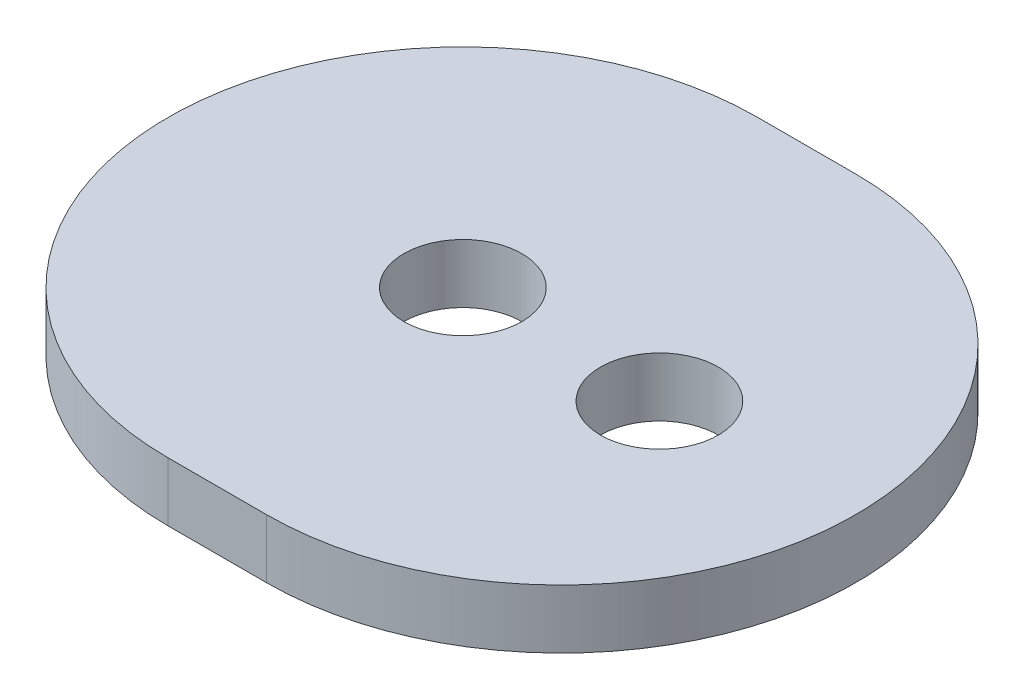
ISO-10303-21;
HEADER;
FILE_DESCRIPTION(('STEP AP214'),'2;1');
FILE_NAME('part.step','',(''),(''),'','','');
FILE_SCHEMA(('AUTOMOTIVE_DESIGN { 1 0 10303 214 1 1 1 1 }'));
ENDSEC;
DATA;
#1=APPLICATION_CONTEXT('core data for automotive mechanical design processes');
#2=APPLICATION_PROTOCOL_DEFINITION('international standard','automotive_design',2000,#1);
#3=PRODUCT_CONTEXT('',#1,'mechanical');
#4=PRODUCT('Part','Part','',(#3));
#5=PRODUCT_RELATED_PRODUCT_CATEGORY('part','',(#4));
#6=PRODUCT_DEFINITION_FORMATION('','',#4);
#7=PRODUCT_DEFINITION_CONTEXT('part definition',#1,'design');
#8=PRODUCT_DEFINITION('design','',#6,#7);
#9=PRODUCT_DEFINITION_SHAPE('','',#8);
#10=(LENGTH_UNIT() NAMED_UNIT(*) SI_UNIT(.MILLI.,.METRE.));
#11=(NAMED_UNIT(*) PLANE_ANGLE_UNIT() SI_UNIT($,.RADIAN.));
#12=(NAMED_UNIT(*) SI_UNIT($,.STERADIAN.) SOLID_ANGLE_UNIT());
#13=UNCERTAINTY_MEASURE_WITH_UNIT(LENGTH_MEASURE(1.E-05),#10,'distance_accuracy_value','');
#14=(GEOMETRIC_REPRESENTATION_CONTEXT(3) GLOBAL_UNCERTAINTY_ASSIGNED_CONTEXT((#13)) GLOBAL_UNIT_ASSIGNED_CONTEXT((#10,
#11,#12)) REPRESENTATION_CONTEXT('',''));
#15=CARTESIAN_POINT('',(0.,0.,0.));
#16=DIRECTION('',(0.,0.,1.));
#17=DIRECTION('',(1.,0.,0.));
#18=AXIS2_PLACEMENT_3D('',#15,#16,#17);
#19=CARTESIAN_POINT('',(5.,3.,0.));
#20=DIRECTION('',(0.,1.,0.));
#21=DIRECTION('',(0.,0.,1.));
#22=AXIS2_PLACEMENT_3D('',#19,#20,#21);
#23=PLANE('',#22);
#24=CARTESIAN_POINT('',(10.,3.,0.));
#25=DIRECTION('',(0.,1.,0.));
#26=DIRECTION('',(0.,0.,1.));
#27=AXIS2_PLACEMENT_3D('',#24,#25,#26);
#28=CIRCLE('',#27,3.);
#29=CARTESIAN_POINT('',(10.,3.,3.));
#30=VERTEX_POINT('',#29);
#31=EDGE_CURVE('E89',#30,#30,#28,.T.);
#32=ORIENTED_EDGE('',*,*,#31,.F.);
#33=EDGE_LOOP('',(#32));
#34=FACE_BOUND('',#33,.T.);
#35=CARTESIAN_POINT('',(5.,3.,0.));
#36=DIRECTION('',(0.,1.,0.));
#37=DIRECTION('',(0.,0.,1.));
#38=AXIS2_PLACEMENT_3D('',#35,#36,#37);
#39=CIRCLE('',#38,15.);
#40=CARTESIAN_POINT('',(5.,3.,15.));
#41=VERTEX_POINT('',#40);
#42=CARTESIAN_POINT('',(5.,3.,-15.));
#43=VERTEX_POINT('',#42);
#44=EDGE_CURVE('E99',#41,#43,#39,.T.);
#45=ORIENTED_EDGE('',*,*,#44,.T.);
#46=DIRECTION('',(-1.,0.,0.));
#47=VECTOR('',#46,1.);
#48=CARTESIAN_POINT('',(5.,3.,-15.));
#49=LINE('',#48,#47);
#50=CARTESIAN_POINT('',(0.,3.,-15.));
#51=VERTEX_POINT('',#50);
#52=EDGE_CURVE('E84',#43,#51,#49,.T.);
#53=ORIENTED_EDGE('',*,*,#52,.T.);
#54=CARTESIAN_POINT('',(0.,3.,0.));
#55=DIRECTION('',(0.,1.,0.));
#56=DIRECTION('',(0.,0.,1.));
#57=AXIS2_PLACEMENT_3D('',#54,#55,#56);
#58=CIRCLE('',#57,15.);
#59=CARTESIAN_POINT('',(0.,3.,15.));
#60=VERTEX_POINT('',#59);
#61=EDGE_CURVE('E50',#51,#60,#58,.T.);
#62=ORIENTED_EDGE('',*,*,#61,.T.);
#63=DIRECTION('',(1.,0.,0.));
#64=VECTOR('',#63,1.);
#65=CARTESIAN_POINT('',(5.,3.,15.));
#66=LINE('',#65,#64);
#67=EDGE_CURVE('E45',#60,#41,#66,.T.);
#68=ORIENTED_EDGE('',*,*,#67,.T.);
#69=EDGE_LOOP('',(#45,#53,#62,#68));
#70=FACE_BOUND('',#69,.T.);
#71=CARTESIAN_POINT('',(0.,3.,0.));
#72=DIRECTION('',(0.,1.,0.));
#73=DIRECTION('',(0.,0.,1.));
#74=AXIS2_PLACEMENT_3D('',#71,#72,#73);
#75=CIRCLE('',#74,3.);
#76=CARTESIAN_POINT('',(0.,3.,3.));
#77=VERTEX_POINT('',#76);
#78=EDGE_CURVE('E117',#77,#77,#75,.T.);
#79=ORIENTED_EDGE('',*,*,#78,.F.);
#80=EDGE_LOOP('',(#79));
#81=FACE_BOUND('',#80,.T.);
#82=ADVANCED_FACE('F30',(#34,#70,#81),#23,.T.);
#83=CARTESIAN_POINT('',(5.,0.,0.));
#84=DIRECTION('',(0.,1.,0.));
#85=DIRECTION('',(0.,0.,1.));
#86=AXIS2_PLACEMENT_3D('',#83,#84,#85);
#87=PLANE('',#86);
#88=CARTESIAN_POINT('',(10.,0.,0.));
#89=DIRECTION('',(0.,1.,0.));
#90=DIRECTION('',(0.,0.,1.));
#91=AXIS2_PLACEMENT_3D('',#88,#89,#90);
#92=CIRCLE('',#91,3.);
#93=CARTESIAN_POINT('',(10.,0.,3.));
#94=VERTEX_POINT('',#93);
#95=EDGE_CURVE('E92',#94,#94,#92,.T.);
#96=ORIENTED_EDGE('',*,*,#95,.T.);
#97=EDGE_LOOP('',(#96));
#98=FACE_BOUND('',#97,.T.);
#99=CARTESIAN_POINT('',(5.,0.,0.));
#100=DIRECTION('',(0.,1.,0.));
#101=DIRECTION('',(0.,0.,1.));
#102=AXIS2_PLACEMENT_3D('',#99,#100,#101);
#103=CIRCLE('',#102,15.);
#104=CARTESIAN_POINT('',(5.,0.,15.));
#105=VERTEX_POINT('',#104);
#106=CARTESIAN_POINT('',(5.,0.,-15.));
#107=VERTEX_POINT('',#106);
#108=EDGE_CURVE('E76',#105,#107,#103,.T.);
#109=ORIENTED_EDGE('',*,*,#108,.F.);
#110=DIRECTION('',(1.,0.,0.));
#111=VECTOR('',#110,1.);
#112=CARTESIAN_POINT('',(5.,0.,15.));
#113=LINE('',#112,#111);
#114=CARTESIAN_POINT('',(0.,0.,15.));
#115=VERTEX_POINT('',#114);
#116=EDGE_CURVE('E97',#115,#105,#113,.T.);
#117=ORIENTED_EDGE('',*,*,#116,.F.);
#118=CARTESIAN_POINT('',(0.,0.,0.));
#119=DIRECTION('',(0.,1.,0.));
#120=DIRECTION('',(0.,0.,1.));
#121=AXIS2_PLACEMENT_3D('',#118,#119,#120);
#122=CIRCLE('',#121,15.);
#123=CARTESIAN_POINT('',(0.,0.,-15.));
#124=VERTEX_POINT('',#123);
#125=EDGE_CURVE('E77',#124,#115,#122,.T.);
#126=ORIENTED_EDGE('',*,*,#125,.F.);
#127=DIRECTION('',(-1.,0.,0.));
#128=VECTOR('',#127,1.);
#129=CARTESIAN_POINT('',(5.,0.,-15.));
#130=LINE('',#129,#128);
#131=EDGE_CURVE('E71',#107,#124,#130,.T.);
#132=ORIENTED_EDGE('',*,*,#131,.F.);
#133=EDGE_LOOP('',(#109,#117,#126,#132));
#134=FACE_BOUND('',#133,.T.);
#135=CARTESIAN_POINT('',(0.,0.,0.));
#136=DIRECTION('',(0.,1.,0.));
#137=DIRECTION('',(0.,0.,1.));
#138=AXIS2_PLACEMENT_3D('',#135,#136,#137);
#139=CIRCLE('',#138,3.);
#140=CARTESIAN_POINT('',(0.,0.,3.));
#141=VERTEX_POINT('',#140);
#142=EDGE_CURVE('E119',#141,#141,#139,.T.);
#143=ORIENTED_EDGE('',*,*,#142,.T.);
#144=EDGE_LOOP('',(#143));
#145=FACE_BOUND('',#144,.T.);
#146=ADVANCED_FACE('F72',(#98,#134,#145),#87,.F.);
#147=CARTESIAN_POINT('',(5.,3.,0.));
#148=DIRECTION('',(0.,-1.,0.));
#149=DIRECTION('',(0.,0.,-1.));
#150=AXIS2_PLACEMENT_3D('',#147,#148,#149);
#151=CYLINDRICAL_SURFACE('',#150,15.);
#152=ORIENTED_EDGE('',*,*,#108,.T.);
#153=DIRECTION('',(0.,-1.,0.));
#154=VECTOR('',#153,1.);
#155=CARTESIAN_POINT('',(5.,3.,-15.));
#156=LINE('',#155,#154);
#157=EDGE_CURVE('E11',#43,#107,#156,.T.);
#158=ORIENTED_EDGE('',*,*,#157,.F.);
#159=ORIENTED_EDGE('',*,*,#44,.F.);
#160=DIRECTION('',(0.,-1.,0.));
#161=VECTOR('',#160,1.);
#162=CARTESIAN_POINT('',(5.,3.,15.));
#163=LINE('',#162,#161);
#164=EDGE_CURVE('E88',#41,#105,#163,.T.);
#165=ORIENTED_EDGE('',*,*,#164,.T.);
#166=EDGE_LOOP('',(#152,#158,#159,#165));
#167=FACE_BOUND('',#166,.T.);
#168=ADVANCED_FACE('F32',(#167),#151,.T.);
#169=CARTESIAN_POINT('',(5.,3.,-15.));
#170=DIRECTION('',(0.,0.,1.));
#171=DIRECTION('',(1.,0.,0.));
#172=AXIS2_PLACEMENT_3D('',#169,#170,#171);
#173=PLANE('',#172);
#174=ORIENTED_EDGE('',*,*,#131,.T.);
#175=DIRECTION('',(0.,-1.,0.));
#176=VECTOR('',#175,1.);
#177=CARTESIAN_POINT('',(0.,3.,-15.));
#178=LINE('',#177,#176);
#179=EDGE_CURVE('E38',#51,#124,#178,.T.);
#180=ORIENTED_EDGE('',*,*,#179,.F.);
#181=ORIENTED_EDGE('',*,*,#52,.F.);
#182=ORIENTED_EDGE('',*,*,#157,.T.);
#183=EDGE_LOOP('',(#174,#180,#181,#182));
#184=FACE_BOUND('',#183,.T.);
#185=ADVANCED_FACE('F83',(#184),#173,.F.);
#186=CARTESIAN_POINT('',(0.,3.,0.));
#187=DIRECTION('',(0.,-1.,0.));
#188=DIRECTION('',(0.,0.,-1.));
#189=AXIS2_PLACEMENT_3D('',#186,#187,#188);
#190=CYLINDRICAL_SURFACE('',#189,15.);
#191=ORIENTED_EDGE('',*,*,#125,.T.);
#192=DIRECTION('',(0.,-1.,0.));
#193=VECTOR('',#192,1.);
#194=CARTESIAN_POINT('',(0.,3.,15.));
#195=LINE('',#194,#193);
#196=EDGE_CURVE('E105',#60,#115,#195,.T.);
#197=ORIENTED_EDGE('',*,*,#196,.F.);
#198=ORIENTED_EDGE('',*,*,#61,.F.);
#199=ORIENTED_EDGE('',*,*,#179,.T.);
#200=EDGE_LOOP('',(#191,#197,#198,#199));
#201=FACE_BOUND('',#200,.T.);
#202=ADVANCED_FACE('F108',(#201),#190,.T.);
#203=CARTESIAN_POINT('',(5.,3.,15.));
#204=DIRECTION('',(0.,0.,-1.));
#205=DIRECTION('',(-1.,0.,0.));
#206=AXIS2_PLACEMENT_3D('',#203,#204,#205);
#207=PLANE('',#206);
#208=ORIENTED_EDGE('',*,*,#116,.T.);
#209=ORIENTED_EDGE('',*,*,#164,.F.);
#210=ORIENTED_EDGE('',*,*,#67,.F.);
#211=ORIENTED_EDGE('',*,*,#196,.T.);
#212=EDGE_LOOP('',(#208,#209,#210,#211));
#213=FACE_BOUND('',#212,.T.);
#214=ADVANCED_FACE('F110',(#213),#207,.F.);
#215=CARTESIAN_POINT('',(10.,3.,0.));
#216=DIRECTION('',(0.,-1.,0.));
#217=DIRECTION('',(0.,0.,-1.));
#218=AXIS2_PLACEMENT_3D('',#215,#216,#217);
#219=CYLINDRICAL_SURFACE('',#218,3.);
#220=ORIENTED_EDGE('',*,*,#31,.T.);
#221=EDGE_LOOP('',(#220));
#222=FACE_BOUND('',#221,.T.);
#223=ORIENTED_EDGE('',*,*,#95,.F.);
#224=EDGE_LOOP('',(#223));
#225=FACE_BOUND('',#224,.T.);
#226=ADVANCED_FACE('F128',(#222,#225),#219,.F.);
#227=CARTESIAN_POINT('',(0.,3.,0.));
#228=DIRECTION('',(0.,-1.,0.));
#229=DIRECTION('',(0.,0.,-1.));
#230=AXIS2_PLACEMENT_3D('',#227,#228,#229);
#231=CYLINDRICAL_SURFACE('',#230,3.);
#232=ORIENTED_EDGE('',*,*,#78,.T.);
#233=EDGE_LOOP('',(#232));
#234=FACE_BOUND('',#233,.T.);
#235=ORIENTED_EDGE('',*,*,#142,.F.);
#236=EDGE_LOOP('',(#235));
#237=FACE_BOUND('',#236,.T.);
#238=ADVANCED_FACE('F126',(#234,#237),#231,.F.);
#239=CLOSED_SHELL('',(#82,#146,#168,#185,#202,#214,#226,#238));
#240=MANIFOLD_SOLID_BREP('B2',#239);
#241=ADVANCED_BREP_SHAPE_REPRESENTATION('',(#18,#240),#14);
#242=SHAPE_DEFINITION_REPRESENTATION(#9,#241);
ENDSEC;
END-ISO-10303-21;
